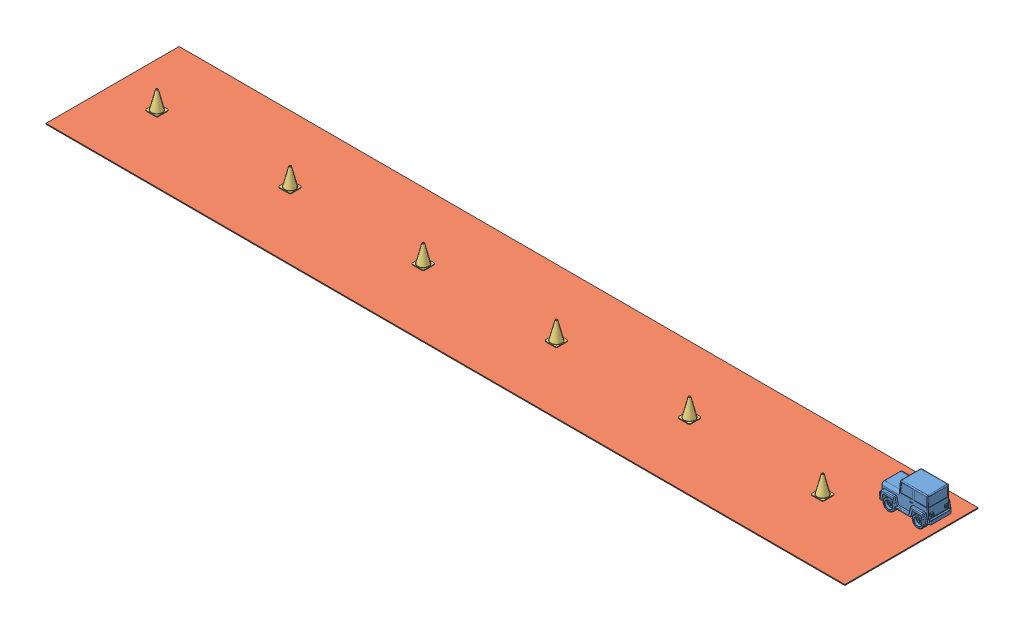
SolidWorks assembly jeep_through_cones.SLDASM, configuration Default (file format 7000). Lengths in mm.
Overall size (2286 618.14 1328.42).
8 component instances, 3 part files, 2 mates.
Components (placement in the parent):
- SW3dPS-Jeep-1: SW3dPS-Jeep.SLDPRT [Default] at (-142.5116 -21.59 -168.4376) x (1 0 0.000863) z (-0.000863 0 1) size (147.32 89.16 76.2)
- road-1: road.SLDPRT [Default] at (-0.6789 -45.72 -50.7504) x (-1 0 0) z (0 1 0) size (2286 381 2.54)
- red_cone-1: red_cone.SLDPRT [Default] at (-254.6789 -41.2496 -50.7504) size (34.29 52.73 34.29)
- red_cone-2: red_cone.SLDPRT [Default] at (-635.6789 -41.2496 -50.7504) size (34.29 52.73 34.29)
- red_cone-3: red_cone.SLDPRT [Default] at (-1016.6789 -41.2496 -50.7504) size (34.29 52.73 34.29)
- red_cone-4: red_cone.SLDPRT [Default] at (-1397.6789 -41.2496 -50.7504) size (34.29 52.73 34.29)
- red_cone-5: red_cone.SLDPRT [Default] at (-1778.6789 -41.2496 -50.7504) size (34.29 52.73 34.29)
- red_cone-6: red_cone.SLDPRT [Default] at (-2159.6789 -41.2496 -50.7504) size (34.29 52.73 34.29)
Mates (geometry in assembly coordinates):
- PathMate1: path: point of SW3dPS-Jeep-1; curve of assembly; plane of road-1 through (-0.6789 -43.18 -241.2504) normal (0 1 0)
- Distance1: distance = 76.2 mm: point of SW3dPS-Jeep-1; plane of road-1 through (-0.6789 -43.18 139.7496) normal (1 0 0)
